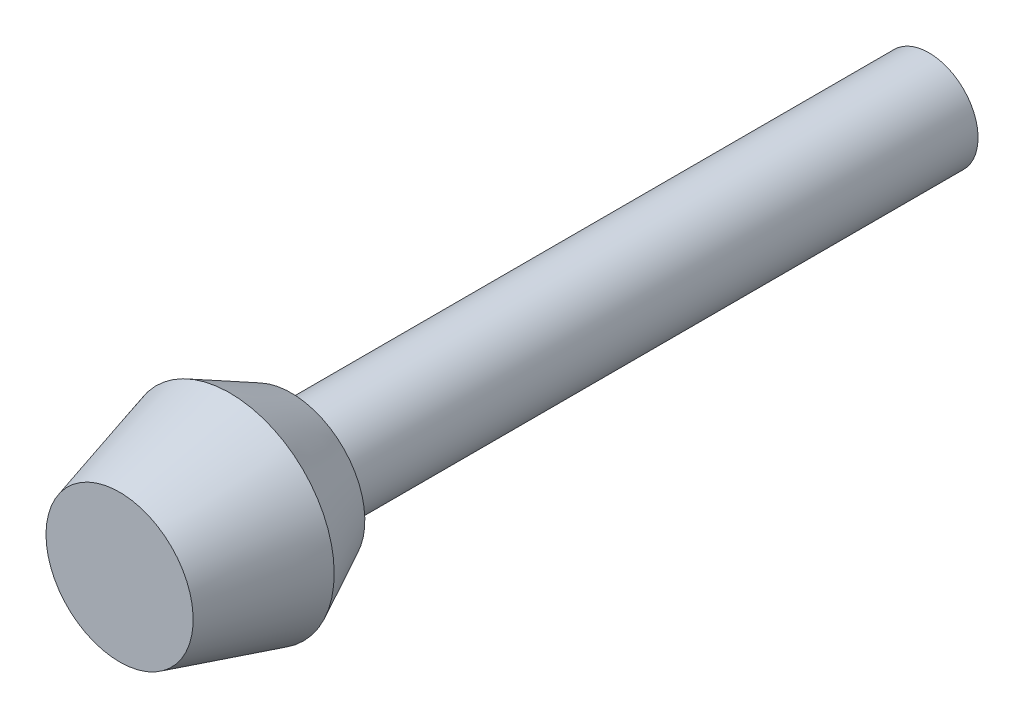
ISO-10303-21;
HEADER;
FILE_DESCRIPTION(('STEP AP214'),'2;1');
FILE_NAME('part.step','',(''),(''),'','','');
FILE_SCHEMA(('AUTOMOTIVE_DESIGN { 1 0 10303 214 1 1 1 1 }'));
ENDSEC;
DATA;
#1=APPLICATION_CONTEXT('core data for automotive mechanical design processes');
#2=APPLICATION_PROTOCOL_DEFINITION('international standard','automotive_design',2000,#1);
#3=PRODUCT_CONTEXT('',#1,'mechanical');
#4=PRODUCT('Part','Part','',(#3));
#5=PRODUCT_RELATED_PRODUCT_CATEGORY('part','',(#4));
#6=PRODUCT_DEFINITION_FORMATION('','',#4);
#7=PRODUCT_DEFINITION_CONTEXT('part definition',#1,'design');
#8=PRODUCT_DEFINITION('design','',#6,#7);
#9=PRODUCT_DEFINITION_SHAPE('','',#8);
#10=(LENGTH_UNIT() NAMED_UNIT(*) SI_UNIT(.MILLI.,.METRE.));
#11=(NAMED_UNIT(*) PLANE_ANGLE_UNIT() SI_UNIT($,.RADIAN.));
#12=(NAMED_UNIT(*) SI_UNIT($,.STERADIAN.) SOLID_ANGLE_UNIT());
#13=UNCERTAINTY_MEASURE_WITH_UNIT(LENGTH_MEASURE(1.E-05),#10,'distance_accuracy_value','');
#14=(GEOMETRIC_REPRESENTATION_CONTEXT(3) GLOBAL_UNCERTAINTY_ASSIGNED_CONTEXT((#13)) GLOBAL_UNIT_ASSIGNED_CONTEXT((#10,
#11,#12)) REPRESENTATION_CONTEXT('',''));
#15=CARTESIAN_POINT('',(0.,0.,0.));
#16=DIRECTION('',(0.,0.,1.));
#17=DIRECTION('',(1.,0.,0.));
#18=AXIS2_PLACEMENT_3D('',#15,#16,#17);
#19=CARTESIAN_POINT('',(0.,-8.59409758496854E-05,0.241514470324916));
#20=DIRECTION('',(0.,-0.000355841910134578,0.999999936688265));
#21=DIRECTION('',(0.63911972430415,-0.769107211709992,-0.000273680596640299));
#22=AXIS2_PLACEMENT_3D('',#19,#20,#21);
#23=PLANE('',#22);
#24=CARTESIAN_POINT('',(0.,-8.59409758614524E-05,0.241514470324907));
#25=DIRECTION('',(0.,-0.000355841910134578,0.999999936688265));
#26=DIRECTION('',(0.,-0.999999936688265,-0.000355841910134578));
#27=AXIS2_PLACEMENT_3D('',#24,#25,#26);
#28=CIRCLE('',#27,6.00000000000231);
#29=CARTESIAN_POINT('',(-3.83471834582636,4.61455732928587,0.243156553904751));
#30=VERTEX_POINT('',#29);
#31=EDGE_CURVE('E30',#30,#30,#28,.F.);
#32=ORIENTED_EDGE('',*,*,#31,.F.);
#33=EDGE_LOOP('',(#32));
#34=FACE_BOUND('',#33,.T.);
#35=ADVANCED_FACE('F12',(#34),#23,.T.);
#36=CARTESIAN_POINT('',(0.,0.00305067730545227,-8.57312482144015));
#37=DIRECTION('',(0.,0.000355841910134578,-0.999999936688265));
#38=DIRECTION('',(-0.63911972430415,0.769107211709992,0.000273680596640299));
#39=AXIS2_PLACEMENT_3D('',#36,#37,#38);
#40=CONICAL_SURFACE('',#39,8.44851106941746,0.270946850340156);
#41=CARTESIAN_POINT('',(0.,0.00311663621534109,-8.75848495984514));
#42=DIRECTION('',(0.,-0.000355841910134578,0.999999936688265));
#43=DIRECTION('',(0.,-0.999999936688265,-0.000355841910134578));
#44=AXIS2_PLACEMENT_3D('',#41,#42,#43);
#45=CIRCLE('',#44,8.50000000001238);
#46=CARTESIAN_POINT('',(-5.43251765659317,6.54052793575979,-8.75615867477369));
#47=VERTEX_POINT('',#46);
#48=EDGE_CURVE('E19',#47,#47,#45,.T.);
#49=CARTESIAN_POINT('',(-3.83471834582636,4.61455732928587,0.243156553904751));
#50=CARTESIAN_POINT('',(-3.85136208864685,4.63461952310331,0.149413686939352));
#51=CARTESIAN_POINT('',(-3.86800583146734,4.65468171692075,0.0556708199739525));
#52=CARTESIAN_POINT('',(-3.90129331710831,4.69480610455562,-0.131814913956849));
#53=CARTESIAN_POINT('',(-3.9179370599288,4.71486829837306,-0.22555778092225));
#54=CARTESIAN_POINT('',(-3.95122454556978,4.75499268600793,-0.413043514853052));
#55=CARTESIAN_POINT('',(-3.96786828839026,4.77505487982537,-0.506786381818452));
#56=CARTESIAN_POINT('',(-4.00115577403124,4.81517926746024,-0.694272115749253));
#57=CARTESIAN_POINT('',(-4.01779951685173,4.83524146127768,-0.788014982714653));
#58=CARTESIAN_POINT('',(-4.0510870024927,4.87536584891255,-0.975500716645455));
#59=CARTESIAN_POINT('',(-4.06773074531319,4.89542804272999,-1.06924358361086));
#60=CARTESIAN_POINT('',(-4.10101823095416,4.93555243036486,-1.25672931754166));
#61=CARTESIAN_POINT('',(-4.11766197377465,4.9556146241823,-1.35047218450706));
#62=CARTESIAN_POINT('',(-4.15094945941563,4.99573901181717,-1.53795791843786));
#63=CARTESIAN_POINT('',(-4.16759320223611,5.01580120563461,-1.63170078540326));
#64=CARTESIAN_POINT('',(-4.20088068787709,5.05592559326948,-1.81918651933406));
#65=CARTESIAN_POINT('',(-4.21752443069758,5.07598778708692,-1.91292938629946));
#66=CARTESIAN_POINT('',(-4.25081191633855,5.11611217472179,-2.10041512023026));
#67=CARTESIAN_POINT('',(-4.26745565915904,5.13617436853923,-2.19415798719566));
#68=CARTESIAN_POINT('',(-4.30074314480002,5.1762987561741,-2.38164372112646));
#69=CARTESIAN_POINT('',(-4.3173868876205,5.19636094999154,-2.47538658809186));
#70=CARTESIAN_POINT('',(-4.35067437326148,5.23648533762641,-2.66287232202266));
#71=CARTESIAN_POINT('',(-4.36731811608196,5.25654753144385,-2.75661518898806));
#72=CARTESIAN_POINT('',(-4.40060560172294,5.29667191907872,-2.94410092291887));
#73=CARTESIAN_POINT('',(-4.41724934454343,5.31673411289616,-3.03784378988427));
#74=CARTESIAN_POINT('',(-4.4505368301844,5.35685850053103,-3.22532952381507));
#75=CARTESIAN_POINT('',(-4.46718057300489,5.37692069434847,-3.31907239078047));
#76=CARTESIAN_POINT('',(-4.50046805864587,5.41704508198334,-3.50655812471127));
#77=CARTESIAN_POINT('',(-4.51711180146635,5.43710727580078,-3.60030099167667));
#78=CARTESIAN_POINT('',(-4.55039928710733,5.47723166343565,-3.78778672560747));
#79=CARTESIAN_POINT('',(-4.56704302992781,5.49729385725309,-3.88152959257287));
#80=CARTESIAN_POINT('',(-4.60033051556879,5.53741824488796,-4.06901532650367));
#81=CARTESIAN_POINT('',(-4.61697425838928,5.5574804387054,-4.16275819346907));
#82=CARTESIAN_POINT('',(-4.65026174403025,5.59760482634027,-4.35024392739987));
#83=CARTESIAN_POINT('',(-4.66690548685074,5.61766702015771,-4.44398679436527));
#84=CARTESIAN_POINT('',(-4.70019297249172,5.65779140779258,-4.63147252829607));
#85=CARTESIAN_POINT('',(-4.7168367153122,5.67785360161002,-4.72521539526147));
#86=CARTESIAN_POINT('',(-4.75012420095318,5.71797798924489,-4.91270112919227));
#87=CARTESIAN_POINT('',(-4.76676794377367,5.73804018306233,-5.00644399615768));
#88=CARTESIAN_POINT('',(-4.80005542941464,5.7781645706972,-5.19392973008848));
#89=CARTESIAN_POINT('',(-4.81669917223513,5.79822676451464,-5.28767259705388));
#90=CARTESIAN_POINT('',(-4.8499866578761,5.83835115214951,-5.47515833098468));
#91=CARTESIAN_POINT('',(-4.86663040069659,5.85841334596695,-5.56890119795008));
#92=CARTESIAN_POINT('',(-4.89991788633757,5.89853773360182,-5.75638693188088));
#93=CARTESIAN_POINT('',(-4.91656162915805,5.91859992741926,-5.85012979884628));
#94=CARTESIAN_POINT('',(-4.94984911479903,5.95872431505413,-6.03761553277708));
#95=CARTESIAN_POINT('',(-4.96649285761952,5.97878650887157,-6.13135839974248));
#96=CARTESIAN_POINT('',(-4.99978034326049,6.01891089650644,-6.31884413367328));
#97=CARTESIAN_POINT('',(-5.01642408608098,6.03897309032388,-6.41258700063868));
#98=CARTESIAN_POINT('',(-5.04971157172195,6.07909747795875,-6.60007273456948));
#99=CARTESIAN_POINT('',(-5.06635531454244,6.09915967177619,-6.69381560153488));
#100=CARTESIAN_POINT('',(-5.09964280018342,6.13928405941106,-6.88130133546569));
#101=CARTESIAN_POINT('',(-5.1162865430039,6.1593462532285,-6.97504420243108));
#102=CARTESIAN_POINT('',(-5.14957402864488,6.19947064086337,-7.16252993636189));
#103=CARTESIAN_POINT('',(-5.16621777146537,6.21953283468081,-7.25627280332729));
#104=CARTESIAN_POINT('',(-5.19950525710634,6.25965722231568,-7.44375853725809));
#105=CARTESIAN_POINT('',(-5.21614899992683,6.27971941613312,-7.53750140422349));
#106=CARTESIAN_POINT('',(-5.2494364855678,6.31984380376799,-7.72498713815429));
#107=CARTESIAN_POINT('',(-5.26608022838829,6.33990599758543,-7.81873000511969));
#108=CARTESIAN_POINT('',(-5.29936771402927,6.3800303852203,-8.00621573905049));
#109=CARTESIAN_POINT('',(-5.31601145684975,6.40009257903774,-8.09995860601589));
#110=CARTESIAN_POINT('',(-5.34929894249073,6.44021696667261,-8.28744433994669));
#111=CARTESIAN_POINT('',(-5.36594268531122,6.46027916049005,-8.38118720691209));
#112=CARTESIAN_POINT('',(-5.39923017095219,6.50040354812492,-8.56867294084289));
#113=CARTESIAN_POINT('',(-5.41587391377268,6.52046574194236,-8.6624158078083));
#114=CARTESIAN_POINT('',(-5.43251765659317,6.54052793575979,-8.7561586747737));
#115=B_SPLINE_CURVE_WITH_KNOTS('',3,(#49,#50,#51,#52,#53,#54,#55,#56,#57,#58,#59,#60,#61,#62,
#63,#64,#65,#66,#67,#68,#69,#70,#71,#72,#73,#74,#75,#76,#77,#78,#79,#80,#81,#82,#83,#84,#85,#86,
#87,#88,#89,#90,#91,#92,#93,#94,#95,#96,#97,#98,#99,#100,#101,#102,#103,#104,#105,#106,#107,
#108,#109,#110,#111,#112,#113,#114),.UNSPECIFIED.,.F.,.F.,(4,2,2,2,2,2,2,2,2,2,2,2,2,2,2,2,2,2,
2,2,2,2,2,2,2,2,2,2,2,2,2,2,4),(0.,0.291899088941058,0.583798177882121,0.875697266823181,
1.16759635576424,1.4594954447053,1.75139453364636,2.04329362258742,2.33519271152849,
2.62709180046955,2.91899088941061,3.21088997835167,3.50278906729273,3.79468815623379,
4.08658724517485,4.37848633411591,4.67038542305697,4.96228451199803,5.25418360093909,
5.54608268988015,5.83798177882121,6.12988086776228,6.42177995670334,6.7136790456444,
7.00557813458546,7.29747722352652,7.58937631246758,7.88127540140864,8.1731744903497,
8.46507357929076,8.75697266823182,9.04887175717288,9.34077084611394),.UNSPECIFIED.);
#116=EDGE_CURVE('BSEAM51',#30,#47,#115,.T.);
#117=ORIENTED_EDGE('',*,*,#31,.T.);
#118=ORIENTED_EDGE('',*,*,#48,.T.);
#119=ORIENTED_EDGE('',*,*,#116,.T.);
#120=ORIENTED_EDGE('',*,*,#116,.F.);
#121=EDGE_LOOP('',(#117,#119,#118,#120));
#122=FACE_BOUND('',#121,.T.);
#123=ADVANCED_FACE('F51',(#122),#40,.T.);
#124=CARTESIAN_POINT('',(0.,0.00317786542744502,-8.9305535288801));
#125=DIRECTION('',(0.,-0.000355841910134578,0.999999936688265));
#126=DIRECTION('',(0.63911972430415,-0.769107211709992,-0.000273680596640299));
#127=AXIS2_PLACEMENT_3D('',#124,#125,#126);
#128=CONICAL_SURFACE('',#127,8.41396571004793,0.463647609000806);
#129=CARTESIAN_POINT('',(0.,0.00489584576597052,-13.7584846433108));
#130=DIRECTION('',(0.,-0.000355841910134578,0.999999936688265));
#131=DIRECTION('',(0.,-0.999999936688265,-0.000355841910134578));
#132=AXIS2_PLACEMENT_3D('',#129,#130,#131);
#133=CIRCLE('',#132,6.00000000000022);
#134=CARTESIAN_POINT('',(0.,-5.99510377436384,-13.7606196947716));
#135=VERTEX_POINT('',#134);
#136=EDGE_CURVE('E8',#135,#135,#133,.F.);
#137=ORIENTED_EDGE('',*,*,#136,.F.);
#138=EDGE_LOOP('',(#137));
#139=FACE_BOUND('',#138,.T.);
#140=ORIENTED_EDGE('',*,*,#48,.F.);
#141=EDGE_LOOP('',(#140));
#142=FACE_BOUND('',#141,.T.);
#143=ADVANCED_FACE('F14',(#139,#142),#128,.T.);
#144=CARTESIAN_POINT('',(0.,0.0233996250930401,-65.7584813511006));
#145=DIRECTION('',(0.,-0.000355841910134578,0.999999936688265));
#146=DIRECTION('',(0.994107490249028,0.108398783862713,3.85728327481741E-05));
#147=AXIS2_PLACEMENT_3D('',#144,#145,#146);
#148=PLANE('',#147);
#149=CARTESIAN_POINT('',(0.,0.0233996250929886,-65.7584813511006));
#150=DIRECTION('',(0.,-0.000355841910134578,0.999999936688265));
#151=DIRECTION('',(0.,-0.999999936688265,-0.000355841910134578));
#152=AXIS2_PLACEMENT_3D('',#149,#150,#151);
#153=CIRCLE('',#152,4.);
#154=CARTESIAN_POINT('',(-3.97642996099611,-0.410195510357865,-65.7586356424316));
#155=VERTEX_POINT('',#154);
#156=EDGE_CURVE('E23',#155,#155,#153,.T.);
#157=ORIENTED_EDGE('',*,*,#156,.F.);
#158=EDGE_LOOP('',(#157));
#159=FACE_BOUND('',#158,.T.);
#160=ADVANCED_FACE('F47',(#159),#148,.F.);
#161=CARTESIAN_POINT('',(0.,0.000269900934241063,-0.758485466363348));
#162=DIRECTION('',(0.,0.000355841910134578,-0.999999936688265));
#163=DIRECTION('',(-0.994107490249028,-0.108398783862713,-3.85728327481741E-05));
#164=AXIS2_PLACEMENT_3D('',#161,#162,#163);
#165=CYLINDRICAL_SURFACE('',#164,4.);
#166=CARTESIAN_POINT('',(0.,0.00489584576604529,-13.7584846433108));
#167=DIRECTION('',(0.,-0.000355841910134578,0.999999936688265));
#168=DIRECTION('',(0.,-0.999999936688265,-0.000355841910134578));
#169=AXIS2_PLACEMENT_3D('',#166,#167,#168);
#170=CIRCLE('',#169,4.);
#171=CARTESIAN_POINT('',(-3.97642996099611,-0.428699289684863,-13.7586389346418));
#172=VERTEX_POINT('',#171);
#173=EDGE_CURVE('E27',#172,#172,#170,.F.);
#174=CARTESIAN_POINT('',(-3.97642996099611,-0.428699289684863,-13.7586389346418));
#175=CARTESIAN_POINT('',(-3.97642996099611,-0.42850654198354,-14.3003055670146));
#176=CARTESIAN_POINT('',(-3.97642996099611,-0.428313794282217,-14.8419721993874));
#177=CARTESIAN_POINT('',(-3.97642996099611,-0.427928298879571,-15.925305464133));
#178=CARTESIAN_POINT('',(-3.97642996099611,-0.427735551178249,-16.4669720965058));
#179=CARTESIAN_POINT('',(-3.97642996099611,-0.427350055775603,-17.5503053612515));
#180=CARTESIAN_POINT('',(-3.97642996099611,-0.42715730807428,-18.0919719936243));
#181=CARTESIAN_POINT('',(-3.97642996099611,-0.426771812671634,-19.1753052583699));
#182=CARTESIAN_POINT('',(-3.97642996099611,-0.426579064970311,-19.7169718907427));
#183=CARTESIAN_POINT('',(-3.97642996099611,-0.426193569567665,-20.8003051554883));
#184=CARTESIAN_POINT('',(-3.97642996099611,-0.426000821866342,-21.3419717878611));
#185=CARTESIAN_POINT('',(-3.97642996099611,-0.425615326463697,-22.4253050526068));
#186=CARTESIAN_POINT('',(-3.97642996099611,-0.425422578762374,-22.9669716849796));
#187=CARTESIAN_POINT('',(-3.97642996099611,-0.425037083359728,-24.0503049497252));
#188=CARTESIAN_POINT('',(-3.97642996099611,-0.424844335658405,-24.591971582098));
#189=CARTESIAN_POINT('',(-3.97642996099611,-0.424458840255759,-25.6753048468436));
#190=CARTESIAN_POINT('',(-3.97642996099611,-0.424266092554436,-26.2169714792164));
#191=CARTESIAN_POINT('',(-3.97642996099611,-0.423880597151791,-27.300304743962));
#192=CARTESIAN_POINT('',(-3.97642996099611,-0.423687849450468,-27.8419713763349));
#193=CARTESIAN_POINT('',(-3.97642996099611,-0.423302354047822,-28.9253046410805));
#194=CARTESIAN_POINT('',(-3.97642996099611,-0.423109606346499,-29.4669712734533));
#195=CARTESIAN_POINT('',(-3.97642996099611,-0.422724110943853,-30.5503045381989));
#196=CARTESIAN_POINT('',(-3.97642996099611,-0.42253136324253,-31.0919711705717));
#197=CARTESIAN_POINT('',(-3.97642996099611,-0.422145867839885,-32.1753044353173));
#198=CARTESIAN_POINT('',(-3.97642996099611,-0.421953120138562,-32.7169710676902));
#199=CARTESIAN_POINT('',(-3.97642996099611,-0.421567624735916,-33.8003043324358));
#200=CARTESIAN_POINT('',(-3.97642996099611,-0.421374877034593,-34.3419709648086));
#201=CARTESIAN_POINT('',(-3.97642996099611,-0.420989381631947,-35.4253042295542));
#202=CARTESIAN_POINT('',(-3.97642996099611,-0.420796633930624,-35.966970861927));
#203=CARTESIAN_POINT('',(-3.97642996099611,-0.420411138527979,-37.0503041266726));
#204=CARTESIAN_POINT('',(-3.97642996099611,-0.420218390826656,-37.5919707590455));
#205=CARTESIAN_POINT('',(-3.97642996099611,-0.41983289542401,-38.6753040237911));
#206=CARTESIAN_POINT('',(-3.97642996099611,-0.419640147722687,-39.2169706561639));
#207=CARTESIAN_POINT('',(-3.97642996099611,-0.419254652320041,-40.3003039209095));
#208=CARTESIAN_POINT('',(-3.97642996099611,-0.419061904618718,-40.8419705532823));
#209=CARTESIAN_POINT('',(-3.97642996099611,-0.418676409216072,-41.9253038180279));
#210=CARTESIAN_POINT('',(-3.97642996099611,-0.418483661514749,-42.4669704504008));
#211=CARTESIAN_POINT('',(-3.97642996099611,-0.418098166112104,-43.5503037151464));
#212=CARTESIAN_POINT('',(-3.97642996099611,-0.417905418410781,-44.0919703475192));
#213=CARTESIAN_POINT('',(-3.97642996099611,-0.417519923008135,-45.1753036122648));
#214=CARTESIAN_POINT('',(-3.97642996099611,-0.417327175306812,-45.7169702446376));
#215=CARTESIAN_POINT('',(-3.97642996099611,-0.416941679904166,-46.8003035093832));
#216=CARTESIAN_POINT('',(-3.97642996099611,-0.416748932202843,-47.341970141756));
#217=CARTESIAN_POINT('',(-3.97642996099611,-0.416363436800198,-48.4253034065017));
#218=CARTESIAN_POINT('',(-3.97642996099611,-0.416170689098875,-48.9669700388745));
#219=CARTESIAN_POINT('',(-3.97642996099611,-0.415785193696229,-50.0503033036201));
#220=CARTESIAN_POINT('',(-3.97642996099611,-0.415592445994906,-50.5919699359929));
#221=CARTESIAN_POINT('',(-3.97642996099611,-0.41520695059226,-51.6753032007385));
#222=CARTESIAN_POINT('',(-3.97642996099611,-0.415014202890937,-52.2169698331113));
#223=CARTESIAN_POINT('',(-3.97642996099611,-0.414628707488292,-53.300303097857));
#224=CARTESIAN_POINT('',(-3.97642996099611,-0.414435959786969,-53.8419697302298));
#225=CARTESIAN_POINT('',(-3.97642996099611,-0.414050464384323,-54.9253029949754));
#226=CARTESIAN_POINT('',(-3.97642996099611,-0.413857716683,-55.4669696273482));
#227=CARTESIAN_POINT('',(-3.97642996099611,-0.413472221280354,-56.5503028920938));
#228=CARTESIAN_POINT('',(-3.97642996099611,-0.413279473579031,-57.0919695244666));
#229=CARTESIAN_POINT('',(-3.97642996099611,-0.412893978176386,-58.1753027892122));
#230=CARTESIAN_POINT('',(-3.97642996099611,-0.412701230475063,-58.7169694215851));
#231=CARTESIAN_POINT('',(-3.97642996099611,-0.412315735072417,-59.8003026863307));
#232=CARTESIAN_POINT('',(-3.97642996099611,-0.412122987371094,-60.3419693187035));
#233=CARTESIAN_POINT('',(-3.97642996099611,-0.411737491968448,-61.4253025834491));
#234=CARTESIAN_POINT('',(-3.97642996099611,-0.411544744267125,-61.9669692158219));
#235=CARTESIAN_POINT('',(-3.97642996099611,-0.411159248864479,-63.0503024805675));
#236=CARTESIAN_POINT('',(-3.97642996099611,-0.410966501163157,-63.5919691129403));
#237=CARTESIAN_POINT('',(-3.97642996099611,-0.410581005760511,-64.675302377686));
#238=CARTESIAN_POINT('',(-3.97642996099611,-0.410388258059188,-65.2169690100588));
#239=CARTESIAN_POINT('',(-3.97642996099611,-0.410195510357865,-65.7586356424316));
#240=B_SPLINE_CURVE_WITH_KNOTS('',3,(#174,#175,#176,#177,#178,#179,#180,#181,#182,#183,#184,
#185,#186,#187,#188,#189,#190,#191,#192,#193,#194,#195,#196,#197,#198,#199,#200,#201,#202,#203,
#204,#205,#206,#207,#208,#209,#210,#211,#212,#213,#214,#215,#216,#217,#218,#219,#220,#221,#222,
#223,#224,#225,#226,#227,#228,#229,#230,#231,#232,#233,#234,#235,#236,#237,#238,#239),
.UNSPECIFIED.,.F.,.F.,(4,2,2,2,2,2,2,2,2,2,2,2,2,2,2,2,2,2,2,2,2,2,2,2,2,2,2,2,2,2,2,2,4),(0.,
1.625,3.25,4.875,6.5,8.125,9.75,11.375,13.,14.625,16.25,17.875,19.5,21.125,22.75,24.375,26.,
27.625,29.25,30.875,32.5,34.125,35.75,37.375,39.,40.625,42.25,43.875,45.5,47.125,48.75,50.375,
52.),.UNSPECIFIED.);
#241=EDGE_CURVE('BSEAM36',#172,#155,#240,.T.);
#242=ORIENTED_EDGE('',*,*,#173,.T.);
#243=ORIENTED_EDGE('',*,*,#156,.T.);
#244=ORIENTED_EDGE('',*,*,#241,.T.);
#245=ORIENTED_EDGE('',*,*,#241,.F.);
#246=EDGE_LOOP('',(#242,#244,#243,#245));
#247=FACE_BOUND('',#246,.T.);
#248=ADVANCED_FACE('F36',(#247),#165,.T.);
#249=CARTESIAN_POINT('',(0.,0.00489584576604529,-13.7584846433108));
#250=DIRECTION('',(0.,-0.000355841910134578,0.999999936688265));
#251=DIRECTION('',(0.63911972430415,-0.769107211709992,-0.000273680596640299));
#252=AXIS2_PLACEMENT_3D('',#249,#250,#251);
#253=PLANE('',#252);
#254=ORIENTED_EDGE('',*,*,#173,.F.);
#255=EDGE_LOOP('',(#254));
#256=FACE_BOUND('',#255,.T.);
#257=ORIENTED_EDGE('',*,*,#136,.T.);
#258=EDGE_LOOP('',(#257));
#259=FACE_BOUND('',#258,.T.);
#260=ADVANCED_FACE('F39',(#256,#259),#253,.F.);
#261=CLOSED_SHELL('',(#35,#123,#143,#160,#248,#260));
#262=MANIFOLD_SOLID_BREP('B1',#261);
#263=ADVANCED_BREP_SHAPE_REPRESENTATION('',(#18,#262),#14);
#264=SHAPE_DEFINITION_REPRESENTATION(#9,#263);
ENDSEC;
END-ISO-10303-21;
